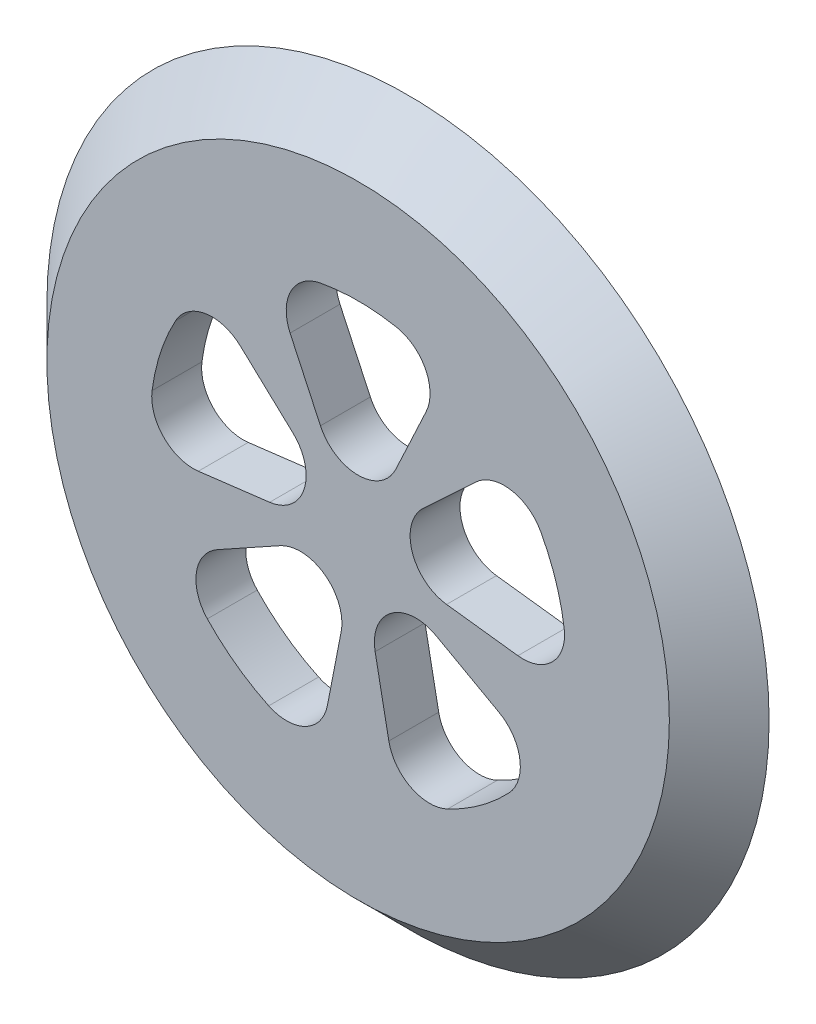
from build123d import *

# Parameters (mm, degrees)
SKETCH1_R           = 2172
BOSS_EXTRUDE1_DEPTH = 300
BOSS_EXTRUDE1_TAPER = 45
CUT_EXTRUDE2_DEPTH  = 3087.287089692
CIRPATTERN1_COUNT   = 5


with BuildPart() as part:
    # Sketch1 → Boss-Extrude1 (new body)
    with BuildSketch(Plane.XY):
        Circle(SKETCH1_R)
    extrude(amount=BOSS_EXTRUDE1_DEPTH, taper=BOSS_EXTRUDE1_TAPER)

    # Sketch2 → Cut-Extrude2 (cut, through all)
    with BuildSketch(Plane.XY.offset(300)):
        with BuildLine():
            Line((-409.198372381, 877.528741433), (-226.576946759, 485.895830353))
            ThreePointArc((-226.576946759, 485.895830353), (0, 341.550395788), (226.576946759, 485.895830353))
            Line((226.576946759, 485.895830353), (409.198372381, 877.528741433))
            ThreePointArc((409.198372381, 877.528741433), (404.898170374, 1097.608167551), (228.276782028, 1228.979133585))
            ThreePointArc((228.276782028, 1228.979133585), (0, 1250), (-228.276782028, 1228.979133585))
            ThreePointArc((-228.276782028, 1228.979133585), (-404.898170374, 1097.608167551), (-409.198372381, 877.528741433))
        make_face()
    cut_extrude2 = extrude(amount=-CUT_EXTRUDE2_DEPTH, mode=Mode.SUBTRACT)

    # CirPattern1: Cut-Extrude2 ×5 about axis
    cirpattern1_axis = Axis((0, 0, 0), (0, 0, 1))
    for i in range(1, CIRPATTERN1_COUNT):
        add(cut_extrude2.rotate(cirpattern1_axis, i * 360 / CIRPATTERN1_COUNT), mode=Mode.SUBTRACT)


solid = part.part
